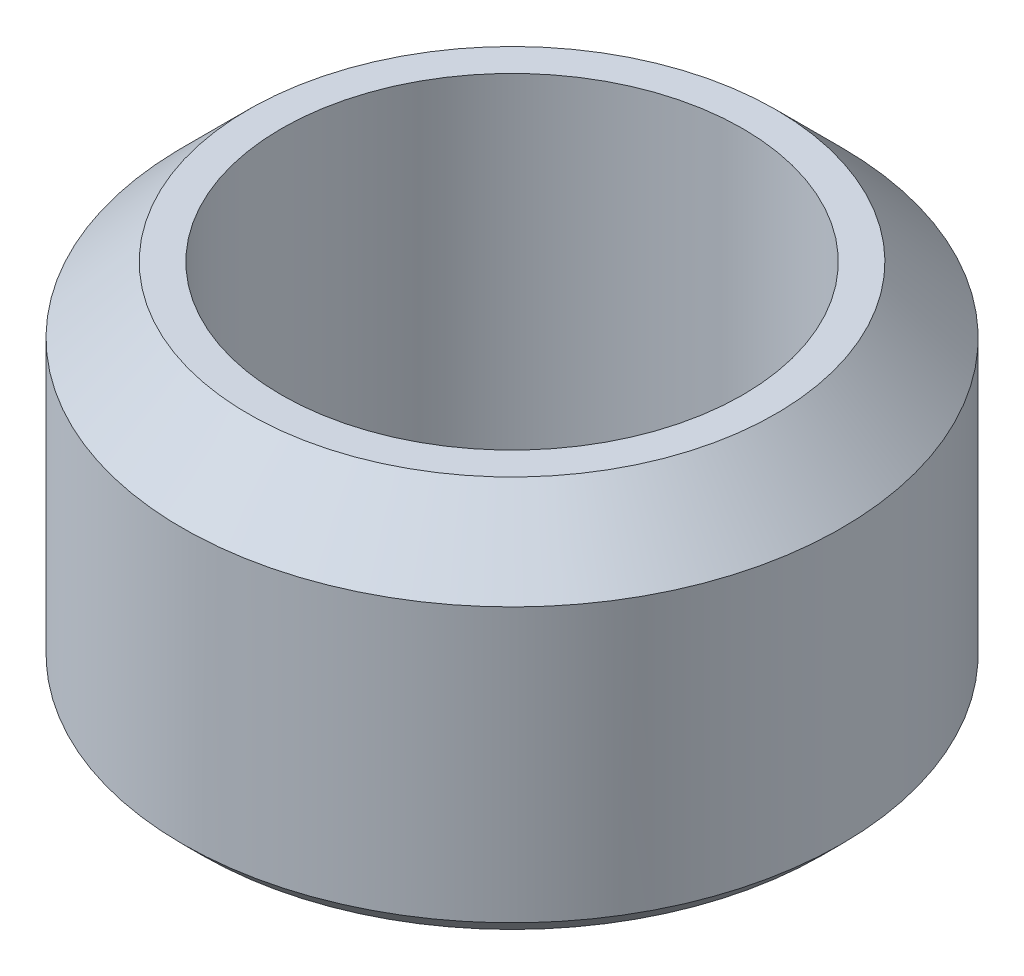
from build123d import *

# Parameters (mm, degrees)
ESQUISSE1_R             = 50
EXTRUSION1_DEPTH        = 54.5
CHANFREIN1_SIZE         = 10
CHANFREIN2_SIZE         = 3
ENL_V_MAT_EXTRU_1_REACH = 91.276
ESQUISSE2_R             = 35


with BuildPart() as part:
    # Esquisse1 → Extrusion1 (new body)
    with BuildSketch(Plane(origin=(0, 0, 0), x_dir=(1, 0, 0), z_dir=(0, 1, 0))):
        with Locations(Location((0, 0, 0), (0, 0, 270))):
            Circle(ESQUISSE1_R)
    extrude(amount=EXTRUSION1_DEPTH)

    # Chanfrein1
    chanfrein1_edges = [part.edges().sort_by_distance(p)[0] for p in [
        (0, 54.5, -50),
    ]]
    chamfer(chanfrein1_edges, length=CHANFREIN1_SIZE)

    # Chanfrein2
    chanfrein2_edges = [part.edges().sort_by_distance(p)[0] for p in [
        (0, 0, -50),
    ]]
    chamfer(chanfrein2_edges, length=CHANFREIN2_SIZE)

    # Esquisse2 → Enl_v. mat.-Extru.1 (cut, up to next)
    with BuildSketch(Plane(origin=(0, 54.5, 0), x_dir=(-1, 0, 0), z_dir=(0, 1, 0)), mode=Mode.PRIVATE) as enl_v_mat_extru_1_sk1:
        with Locations(Location((0, 0, 0), (0, 0, 90))):
            Circle(ESQUISSE2_R)
    enl_v_mat_extru_1_tool1 = extrude(enl_v_mat_extru_1_sk1.sketch, amount=-ENL_V_MAT_EXTRU_1_REACH, mode=Mode.PRIVATE) & part.part
    add(enl_v_mat_extru_1_tool1.solids().sort_by_distance((0, 54.5, 0))[0], mode=Mode.SUBTRACT)


solid = part.part
